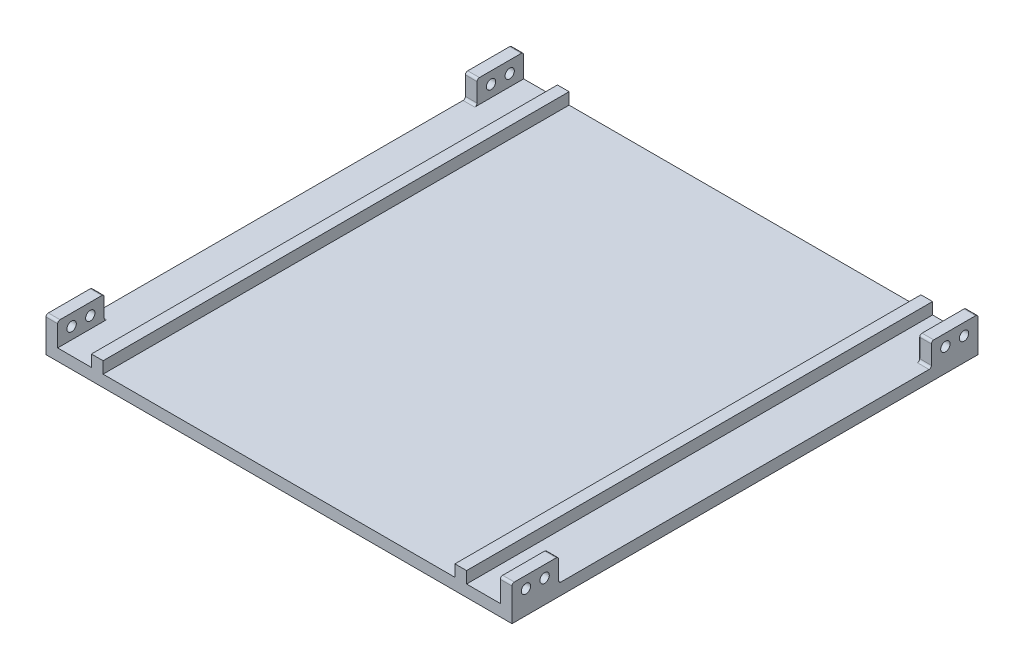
ISO-10303-21;
HEADER;
FILE_DESCRIPTION(('STEP AP214'),'2;1');
FILE_NAME('part.step','',(''),(''),'','','');
FILE_SCHEMA(('AUTOMOTIVE_DESIGN { 1 0 10303 214 1 1 1 1 }'));
ENDSEC;
DATA;
#1=APPLICATION_CONTEXT('core data for automotive mechanical design processes');
#2=APPLICATION_PROTOCOL_DEFINITION('international standard','automotive_design',2000,#1);
#3=PRODUCT_CONTEXT('',#1,'mechanical');
#4=PRODUCT('Part','Part','',(#3));
#5=PRODUCT_RELATED_PRODUCT_CATEGORY('part','',(#4));
#6=PRODUCT_DEFINITION_FORMATION('','',#4);
#7=PRODUCT_DEFINITION_CONTEXT('part definition',#1,'design');
#8=PRODUCT_DEFINITION('design','',#6,#7);
#9=PRODUCT_DEFINITION_SHAPE('','',#8);
#10=(LENGTH_UNIT() NAMED_UNIT(*) SI_UNIT(.MILLI.,.METRE.));
#11=(NAMED_UNIT(*) PLANE_ANGLE_UNIT() SI_UNIT($,.RADIAN.));
#12=(NAMED_UNIT(*) SI_UNIT($,.STERADIAN.) SOLID_ANGLE_UNIT());
#13=UNCERTAINTY_MEASURE_WITH_UNIT(LENGTH_MEASURE(1.E-05),#10,'distance_accuracy_value','');
#14=(GEOMETRIC_REPRESENTATION_CONTEXT(3) GLOBAL_UNCERTAINTY_ASSIGNED_CONTEXT((#13)) GLOBAL_UNIT_ASSIGNED_CONTEXT((#10,
#11,#12)) REPRESENTATION_CONTEXT('',''));
#15=CARTESIAN_POINT('',(0.,0.,0.));
#16=DIRECTION('',(0.,0.,1.));
#17=DIRECTION('',(1.,0.,0.));
#18=AXIS2_PLACEMENT_3D('',#15,#16,#17);
#19=CARTESIAN_POINT('',(100.,-4.99999999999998,100.));
#20=DIRECTION('',(-1.,0.,0.));
#21=DIRECTION('',(0.,0.,1.));
#22=AXIS2_PLACEMENT_3D('',#19,#20,#21);
#23=PLANE('',#22);
#24=CARTESIAN_POINT('',(100.,4.99999999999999,94.));
#25=DIRECTION('',(-1.,0.,0.));
#26=DIRECTION('',(0.,0.,1.));
#27=AXIS2_PLACEMENT_3D('',#24,#25,#26);
#28=CIRCLE('',#27,2.);
#29=CARTESIAN_POINT('',(100.,4.99999999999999,96.));
#30=VERTEX_POINT('',#29);
#31=EDGE_CURVE('E1315',#30,#30,#28,.F.);
#32=ORIENTED_EDGE('',*,*,#31,.F.);
#33=EDGE_LOOP('',(#32));
#34=FACE_BOUND('',#33,.T.);
#35=CARTESIAN_POINT('',(100.,4.99999999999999,-86.));
#36=DIRECTION('',(-1.,0.,0.));
#37=DIRECTION('',(0.,0.,1.));
#38=AXIS2_PLACEMENT_3D('',#35,#36,#37);
#39=CIRCLE('',#38,2.);
#40=CARTESIAN_POINT('',(100.,4.99999999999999,-84.));
#41=VERTEX_POINT('',#40);
#42=EDGE_CURVE('E622',#41,#41,#39,.F.);
#43=ORIENTED_EDGE('',*,*,#42,.F.);
#44=EDGE_LOOP('',(#43));
#45=FACE_BOUND('',#44,.T.);
#46=DIRECTION('',(0.,1.,0.));
#47=VECTOR('',#46,1.);
#48=CARTESIAN_POINT('',(100.,-4.99999999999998,-100.));
#49=LINE('',#48,#47);
#50=CARTESIAN_POINT('',(100.,-4.99999999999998,-100.));
#51=VERTEX_POINT('',#50);
#52=CARTESIAN_POINT('',(100.,8.99999999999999,-100.));
#53=VERTEX_POINT('',#52);
#54=EDGE_CURVE('E504',#51,#53,#49,.T.);
#55=ORIENTED_EDGE('',*,*,#54,.T.);
#56=CARTESIAN_POINT('',(100.,8.99999999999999,-99.));
#57=DIRECTION('',(-1.,0.,0.));
#58=DIRECTION('',(0.,0.,1.));
#59=AXIS2_PLACEMENT_3D('',#56,#57,#58);
#60=CIRCLE('',#59,1.);
#61=CARTESIAN_POINT('',(100.,9.99999999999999,-99.));
#62=VERTEX_POINT('',#61);
#63=EDGE_CURVE('E640',#53,#62,#60,.F.);
#64=ORIENTED_EDGE('',*,*,#63,.T.);
#65=DIRECTION('',(0.,0.,1.));
#66=VECTOR('',#65,1.);
#67=CARTESIAN_POINT('',(100.,9.99999999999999,-100.));
#68=LINE('',#67,#66);
#69=CARTESIAN_POINT('',(100.,9.99999999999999,-81.));
#70=VERTEX_POINT('',#69);
#71=EDGE_CURVE('E315',#62,#70,#68,.T.);
#72=ORIENTED_EDGE('',*,*,#71,.T.);
#73=CARTESIAN_POINT('',(100.,8.99999999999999,-81.));
#74=DIRECTION('',(-1.,0.,0.));
#75=DIRECTION('',(0.,0.,1.));
#76=AXIS2_PLACEMENT_3D('',#73,#74,#75);
#77=CIRCLE('',#76,1.);
#78=CARTESIAN_POINT('',(100.,8.99999999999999,-80.));
#79=VERTEX_POINT('',#78);
#80=EDGE_CURVE('E637',#70,#79,#77,.F.);
#81=ORIENTED_EDGE('',*,*,#80,.T.);
#82=DIRECTION('',(0.,-1.,0.));
#83=VECTOR('',#82,1.);
#84=CARTESIAN_POINT('',(100.,9.99999999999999,-80.));
#85=LINE('',#84,#83);
#86=CARTESIAN_POINT('',(100.,1.00000000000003,-80.));
#87=VERTEX_POINT('',#86);
#88=EDGE_CURVE('E322',#79,#87,#85,.T.);
#89=ORIENTED_EDGE('',*,*,#88,.T.);
#90=CARTESIAN_POINT('',(100.,1.00000000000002,-79.));
#91=DIRECTION('',(-1.,0.,0.));
#92=DIRECTION('',(0.,0.,1.));
#93=AXIS2_PLACEMENT_3D('',#90,#91,#92);
#94=CIRCLE('',#93,1.);
#95=CARTESIAN_POINT('',(100.,0.,-79.));
#96=VERTEX_POINT('',#95);
#97=EDGE_CURVE('E690',#87,#96,#94,.T.);
#98=ORIENTED_EDGE('',*,*,#97,.T.);
#99=DIRECTION('',(0.,0.,-1.));
#100=VECTOR('',#99,1.);
#101=CARTESIAN_POINT('',(100.,0.,100.));
#102=LINE('',#101,#100);
#103=CARTESIAN_POINT('',(100.,0.,79.));
#104=VERTEX_POINT('',#103);
#105=EDGE_CURVE('E511',#104,#96,#102,.T.);
#106=ORIENTED_EDGE('',*,*,#105,.F.);
#107=CARTESIAN_POINT('',(100.,1.00000000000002,79.));
#108=DIRECTION('',(-1.,0.,0.));
#109=DIRECTION('',(0.,0.,1.));
#110=AXIS2_PLACEMENT_3D('',#107,#108,#109);
#111=CIRCLE('',#110,1.);
#112=CARTESIAN_POINT('',(100.,1.00000000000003,80.));
#113=VERTEX_POINT('',#112);
#114=EDGE_CURVE('E46',#104,#113,#111,.T.);
#115=ORIENTED_EDGE('',*,*,#114,.T.);
#116=DIRECTION('',(0.,-1.,0.));
#117=VECTOR('',#116,1.);
#118=CARTESIAN_POINT('',(100.,9.99999999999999,80.));
#119=LINE('',#118,#117);
#120=CARTESIAN_POINT('',(100.,8.99999999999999,80.));
#121=VERTEX_POINT('',#120);
#122=EDGE_CURVE('E345',#121,#113,#119,.T.);
#123=ORIENTED_EDGE('',*,*,#122,.F.);
#124=CARTESIAN_POINT('',(100.,8.99999999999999,81.));
#125=DIRECTION('',(-1.,0.,0.));
#126=DIRECTION('',(0.,0.,1.));
#127=AXIS2_PLACEMENT_3D('',#124,#125,#126);
#128=CIRCLE('',#127,1.);
#129=CARTESIAN_POINT('',(100.,9.99999999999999,81.));
#130=VERTEX_POINT('',#129);
#131=EDGE_CURVE('E634',#121,#130,#128,.F.);
#132=ORIENTED_EDGE('',*,*,#131,.T.);
#133=DIRECTION('',(0.,0.,1.));
#134=VECTOR('',#133,1.);
#135=CARTESIAN_POINT('',(100.,9.99999999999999,100.));
#136=LINE('',#135,#134);
#137=CARTESIAN_POINT('',(100.,9.99999999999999,99.));
#138=VERTEX_POINT('',#137);
#139=EDGE_CURVE('E329',#130,#138,#136,.T.);
#140=ORIENTED_EDGE('',*,*,#139,.T.);
#141=CARTESIAN_POINT('',(100.,8.99999999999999,99.));
#142=DIRECTION('',(-1.,0.,0.));
#143=DIRECTION('',(0.,0.,1.));
#144=AXIS2_PLACEMENT_3D('',#141,#142,#143);
#145=CIRCLE('',#144,1.);
#146=CARTESIAN_POINT('',(100.,8.99999999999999,100.));
#147=VERTEX_POINT('',#146);
#148=EDGE_CURVE('E631',#138,#147,#145,.F.);
#149=ORIENTED_EDGE('',*,*,#148,.T.);
#150=DIRECTION('',(0.,1.,0.));
#151=VECTOR('',#150,1.);
#152=CARTESIAN_POINT('',(100.,-4.99999999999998,100.));
#153=LINE('',#152,#151);
#154=CARTESIAN_POINT('',(100.,-4.99999999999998,100.));
#155=VERTEX_POINT('',#154);
#156=EDGE_CURVE('E489',#155,#147,#153,.T.);
#157=ORIENTED_EDGE('',*,*,#156,.F.);
#158=DIRECTION('',(0.,0.,-1.));
#159=VECTOR('',#158,1.);
#160=CARTESIAN_POINT('',(100.,-4.99999999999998,100.));
#161=LINE('',#160,#159);
#162=EDGE_CURVE('E514',#155,#51,#161,.T.);
#163=ORIENTED_EDGE('',*,*,#162,.T.);
#164=EDGE_LOOP('',(#55,#64,#72,#81,#89,#98,#106,#115,#123,#132,#140,#149,#157,#163));
#165=FACE_BOUND('',#164,.T.);
#166=CARTESIAN_POINT('',(100.,4.99999999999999,86.));
#167=DIRECTION('',(-1.,0.,0.));
#168=DIRECTION('',(0.,0.,1.));
#169=AXIS2_PLACEMENT_3D('',#166,#167,#168);
#170=CIRCLE('',#169,2.);
#171=CARTESIAN_POINT('',(100.,4.99999999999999,88.));
#172=VERTEX_POINT('',#171);
#173=EDGE_CURVE('E1318',#172,#172,#170,.T.);
#174=ORIENTED_EDGE('',*,*,#173,.T.);
#175=EDGE_LOOP('',(#174));
#176=FACE_BOUND('',#175,.T.);
#177=CARTESIAN_POINT('',(100.,4.99999999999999,-94.));
#178=DIRECTION('',(-1.,0.,0.));
#179=DIRECTION('',(0.,0.,1.));
#180=AXIS2_PLACEMENT_3D('',#177,#178,#179);
#181=CIRCLE('',#180,2.);
#182=CARTESIAN_POINT('',(100.,4.99999999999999,-92.));
#183=VERTEX_POINT('',#182);
#184=EDGE_CURVE('E1317',#183,#183,#181,.T.);
#185=ORIENTED_EDGE('',*,*,#184,.T.);
#186=EDGE_LOOP('',(#185));
#187=FACE_BOUND('',#186,.T.);
#188=ADVANCED_FACE('F37',(#34,#45,#165,#176,#187),#23,.F.);
#189=CARTESIAN_POINT('',(95.,9.99999999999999,100.));
#190=DIRECTION('',(-1.,0.,0.));
#191=DIRECTION('',(0.,-1.,0.));
#192=AXIS2_PLACEMENT_3D('',#189,#190,#191);
#193=PLANE('',#192);
#194=CARTESIAN_POINT('',(95.,4.99999999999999,86.));
#195=DIRECTION('',(-1.,0.,0.));
#196=DIRECTION('',(0.,-1.,0.));
#197=AXIS2_PLACEMENT_3D('',#194,#195,#196);
#198=CIRCLE('',#197,2.);
#199=CARTESIAN_POINT('',(95.,3.,86.));
#200=VERTEX_POINT('',#199);
#201=EDGE_CURVE('E318',#200,#200,#198,.F.);
#202=ORIENTED_EDGE('',*,*,#201,.T.);
#203=EDGE_LOOP('',(#202));
#204=FACE_BOUND('',#203,.T.);
#205=DIRECTION('',(0.,0.,-1.));
#206=VECTOR('',#205,1.);
#207=CARTESIAN_POINT('',(95.,9.99999999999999,100.));
#208=LINE('',#207,#206);
#209=CARTESIAN_POINT('',(95.,9.99999999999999,99.));
#210=VERTEX_POINT('',#209);
#211=CARTESIAN_POINT('',(95.,9.99999999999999,81.));
#212=VERTEX_POINT('',#211);
#213=EDGE_CURVE('E333',#210,#212,#208,.T.);
#214=ORIENTED_EDGE('',*,*,#213,.T.);
#215=CARTESIAN_POINT('',(95.,8.99999999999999,81.));
#216=DIRECTION('',(-1.,0.,0.));
#217=DIRECTION('',(0.,-1.,0.));
#218=AXIS2_PLACEMENT_3D('',#215,#216,#217);
#219=CIRCLE('',#218,1.);
#220=CARTESIAN_POINT('',(95.,8.99999999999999,80.));
#221=VERTEX_POINT('',#220);
#222=EDGE_CURVE('E681',#212,#221,#219,.T.);
#223=ORIENTED_EDGE('',*,*,#222,.T.);
#224=DIRECTION('',(0.,-1.,0.));
#225=VECTOR('',#224,1.);
#226=CARTESIAN_POINT('',(95.,9.99999999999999,80.));
#227=LINE('',#226,#225);
#228=CARTESIAN_POINT('',(95.,1.00000000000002,80.));
#229=VERTEX_POINT('',#228);
#230=EDGE_CURVE('E341',#221,#229,#227,.T.);
#231=ORIENTED_EDGE('',*,*,#230,.T.);
#232=CARTESIAN_POINT('',(95.,1.00000000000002,79.));
#233=DIRECTION('',(-1.,0.,0.));
#234=DIRECTION('',(0.,-1.,0.));
#235=AXIS2_PLACEMENT_3D('',#232,#233,#234);
#236=CIRCLE('',#235,1.);
#237=CARTESIAN_POINT('',(95.,0.,79.));
#238=VERTEX_POINT('',#237);
#239=EDGE_CURVE('E11',#229,#238,#236,.F.);
#240=ORIENTED_EDGE('',*,*,#239,.T.);
#241=DIRECTION('',(0.,0.,-1.));
#242=VECTOR('',#241,1.);
#243=CARTESIAN_POINT('',(95.,0.,100.));
#244=LINE('',#243,#242);
#245=CARTESIAN_POINT('',(95.,0.,100.));
#246=VERTEX_POINT('',#245);
#247=EDGE_CURVE('E287',#246,#238,#244,.T.);
#248=ORIENTED_EDGE('',*,*,#247,.F.);
#249=DIRECTION('',(0.,-1.,0.));
#250=VECTOR('',#249,1.);
#251=CARTESIAN_POINT('',(95.,9.99999999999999,100.));
#252=LINE('',#251,#250);
#253=CARTESIAN_POINT('',(95.,8.99999999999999,100.));
#254=VERTEX_POINT('',#253);
#255=EDGE_CURVE('E336',#254,#246,#252,.T.);
#256=ORIENTED_EDGE('',*,*,#255,.F.);
#257=CARTESIAN_POINT('',(95.,8.99999999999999,99.));
#258=DIRECTION('',(-1.,0.,0.));
#259=DIRECTION('',(0.,-1.,0.));
#260=AXIS2_PLACEMENT_3D('',#257,#258,#259);
#261=CIRCLE('',#260,1.);
#262=EDGE_CURVE('E53',#254,#210,#261,.T.);
#263=ORIENTED_EDGE('',*,*,#262,.T.);
#264=EDGE_LOOP('',(#214,#223,#231,#240,#248,#256,#263));
#265=FACE_BOUND('',#264,.T.);
#266=CARTESIAN_POINT('',(95.,4.99999999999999,94.));
#267=DIRECTION('',(-1.,0.,0.));
#268=DIRECTION('',(0.,-1.,0.));
#269=AXIS2_PLACEMENT_3D('',#266,#267,#268);
#270=CIRCLE('',#269,2.);
#271=CARTESIAN_POINT('',(95.,2.99999999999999,94.));
#272=VERTEX_POINT('',#271);
#273=EDGE_CURVE('E311',#272,#272,#270,.T.);
#274=ORIENTED_EDGE('',*,*,#273,.F.);
#275=EDGE_LOOP('',(#274));
#276=FACE_BOUND('',#275,.T.);
#277=ADVANCED_FACE('F708',(#204,#265,#276),#193,.T.);
#278=CARTESIAN_POINT('',(95.,9.99999999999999,-100.));
#279=DIRECTION('',(-1.,0.,0.));
#280=DIRECTION('',(0.,0.,1.));
#281=AXIS2_PLACEMENT_3D('',#278,#279,#280);
#282=PLANE('',#281);
#283=DIRECTION('',(0.,0.,-1.));
#284=VECTOR('',#283,1.);
#285=CARTESIAN_POINT('',(95.,9.99999999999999,-100.));
#286=LINE('',#285,#284);
#287=CARTESIAN_POINT('',(95.,9.99999999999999,-81.));
#288=VERTEX_POINT('',#287);
#289=CARTESIAN_POINT('',(95.,9.99999999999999,-99.));
#290=VERTEX_POINT('',#289);
#291=EDGE_CURVE('E310',#288,#290,#286,.T.);
#292=ORIENTED_EDGE('',*,*,#291,.T.);
#293=CARTESIAN_POINT('',(95.,8.99999999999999,-99.));
#294=DIRECTION('',(-1.,0.,0.));
#295=DIRECTION('',(0.,0.,1.));
#296=AXIS2_PLACEMENT_3D('',#293,#294,#295);
#297=CIRCLE('',#296,1.);
#298=CARTESIAN_POINT('',(95.,8.99999999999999,-100.));
#299=VERTEX_POINT('',#298);
#300=EDGE_CURVE('E282',#290,#299,#297,.T.);
#301=ORIENTED_EDGE('',*,*,#300,.T.);
#302=DIRECTION('',(0.,-1.,0.));
#303=VECTOR('',#302,1.);
#304=CARTESIAN_POINT('',(95.,9.99999999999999,-100.));
#305=LINE('',#304,#303);
#306=CARTESIAN_POINT('',(95.,0.,-100.));
#307=VERTEX_POINT('',#306);
#308=EDGE_CURVE('E273',#299,#307,#305,.T.);
#309=ORIENTED_EDGE('',*,*,#308,.T.);
#310=DIRECTION('',(0.,0.,-1.));
#311=VECTOR('',#310,1.);
#312=CARTESIAN_POINT('',(95.,0.,-100.));
#313=LINE('',#312,#311);
#314=CARTESIAN_POINT('',(95.,0.,-79.));
#315=VERTEX_POINT('',#314);
#316=EDGE_CURVE('E279',#315,#307,#313,.T.);
#317=ORIENTED_EDGE('',*,*,#316,.F.);
#318=CARTESIAN_POINT('',(95.,1.00000000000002,-79.));
#319=DIRECTION('',(-1.,0.,0.));
#320=DIRECTION('',(0.,0.,1.));
#321=AXIS2_PLACEMENT_3D('',#318,#319,#320);
#322=CIRCLE('',#321,1.);
#323=CARTESIAN_POINT('',(95.,1.00000000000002,-80.));
#324=VERTEX_POINT('',#323);
#325=EDGE_CURVE('E687',#315,#324,#322,.F.);
#326=ORIENTED_EDGE('',*,*,#325,.T.);
#327=DIRECTION('',(0.,-1.,0.));
#328=VECTOR('',#327,1.);
#329=CARTESIAN_POINT('',(95.,9.99999999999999,-80.));
#330=LINE('',#329,#328);
#331=CARTESIAN_POINT('',(95.,8.99999999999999,-80.));
#332=VERTEX_POINT('',#331);
#333=EDGE_CURVE('E288',#332,#324,#330,.T.);
#334=ORIENTED_EDGE('',*,*,#333,.F.);
#335=CARTESIAN_POINT('',(95.,8.99999999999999,-81.));
#336=DIRECTION('',(-1.,0.,0.));
#337=DIRECTION('',(0.,0.,1.));
#338=AXIS2_PLACEMENT_3D('',#335,#336,#337);
#339=CIRCLE('',#338,1.);
#340=EDGE_CURVE('E649',#332,#288,#339,.T.);
#341=ORIENTED_EDGE('',*,*,#340,.T.);
#342=EDGE_LOOP('',(#292,#301,#309,#317,#326,#334,#341));
#343=FACE_BOUND('',#342,.T.);
#344=CARTESIAN_POINT('',(95.,4.99999999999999,-86.));
#345=DIRECTION('',(-1.,0.,0.));
#346=DIRECTION('',(0.,0.,1.));
#347=AXIS2_PLACEMENT_3D('',#344,#345,#346);
#348=CIRCLE('',#347,2.);
#349=CARTESIAN_POINT('',(95.,4.99999999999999,-84.));
#350=VERTEX_POINT('',#349);
#351=EDGE_CURVE('E617',#350,#350,#348,.T.);
#352=ORIENTED_EDGE('',*,*,#351,.F.);
#353=EDGE_LOOP('',(#352));
#354=FACE_BOUND('',#353,.T.);
#355=CARTESIAN_POINT('',(95.,4.99999999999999,-94.));
#356=DIRECTION('',(-1.,0.,0.));
#357=DIRECTION('',(0.,0.,1.));
#358=AXIS2_PLACEMENT_3D('',#355,#356,#357);
#359=CIRCLE('',#358,2.);
#360=CARTESIAN_POINT('',(95.,4.99999999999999,-92.));
#361=VERTEX_POINT('',#360);
#362=EDGE_CURVE('E621',#361,#361,#359,.F.);
#363=ORIENTED_EDGE('',*,*,#362,.T.);
#364=EDGE_LOOP('',(#363));
#365=FACE_BOUND('',#364,.T.);
#366=ADVANCED_FACE('F276',(#343,#354,#365),#282,.T.);
#367=CARTESIAN_POINT('',(-100.,-5.,100.));
#368=DIRECTION('',(1.,0.,0.));
#369=DIRECTION('',(0.,0.,-1.));
#370=AXIS2_PLACEMENT_3D('',#367,#368,#369);
#371=PLANE('',#370);
#372=CARTESIAN_POINT('',(-100.,4.99999999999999,86.));
#373=DIRECTION('',(-1.,0.,0.));
#374=DIRECTION('',(0.,0.,1.));
#375=AXIS2_PLACEMENT_3D('',#372,#373,#374);
#376=CIRCLE('',#375,2.);
#377=CARTESIAN_POINT('',(-100.,4.99999999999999,88.));
#378=VERTEX_POINT('',#377);
#379=EDGE_CURVE('E349',#378,#378,#376,.T.);
#380=ORIENTED_EDGE('',*,*,#379,.F.);
#381=EDGE_LOOP('',(#380));
#382=FACE_BOUND('',#381,.T.);
#383=CARTESIAN_POINT('',(-100.,4.99999999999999,-86.));
#384=DIRECTION('',(-1.,0.,0.));
#385=DIRECTION('',(0.,0.,1.));
#386=AXIS2_PLACEMENT_3D('',#383,#384,#385);
#387=CIRCLE('',#386,2.);
#388=CARTESIAN_POINT('',(-100.,4.99999999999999,-84.));
#389=VERTEX_POINT('',#388);
#390=EDGE_CURVE('E358',#389,#389,#387,.F.);
#391=ORIENTED_EDGE('',*,*,#390,.T.);
#392=EDGE_LOOP('',(#391));
#393=FACE_BOUND('',#392,.T.);
#394=DIRECTION('',(0.,0.,1.));
#395=VECTOR('',#394,1.);
#396=CARTESIAN_POINT('',(-100.,9.99999999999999,-100.));
#397=LINE('',#396,#395);
#398=CARTESIAN_POINT('',(-100.,9.99999999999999,-99.));
#399=VERTEX_POINT('',#398);
#400=CARTESIAN_POINT('',(-100.,9.99999999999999,-81.));
#401=VERTEX_POINT('',#400);
#402=EDGE_CURVE('E366',#399,#401,#397,.T.);
#403=ORIENTED_EDGE('',*,*,#402,.F.);
#404=CARTESIAN_POINT('',(-100.,8.99999999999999,-99.));
#405=DIRECTION('',(1.,0.,0.));
#406=DIRECTION('',(0.,0.,-1.));
#407=AXIS2_PLACEMENT_3D('',#404,#405,#406);
#408=CIRCLE('',#407,1.);
#409=CARTESIAN_POINT('',(-100.,8.99999999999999,-100.));
#410=VERTEX_POINT('',#409);
#411=EDGE_CURVE('E553',#399,#410,#408,.F.);
#412=ORIENTED_EDGE('',*,*,#411,.T.);
#413=DIRECTION('',(0.,-1.,0.));
#414=VECTOR('',#413,1.);
#415=CARTESIAN_POINT('',(-100.,-5.,-100.));
#416=LINE('',#415,#414);
#417=CARTESIAN_POINT('',(-100.,-5.,-100.));
#418=VERTEX_POINT('',#417);
#419=EDGE_CURVE('E483',#410,#418,#416,.T.);
#420=ORIENTED_EDGE('',*,*,#419,.T.);
#421=DIRECTION('',(0.,0.,-1.));
#422=VECTOR('',#421,1.);
#423=CARTESIAN_POINT('',(-100.,-5.,100.));
#424=LINE('',#423,#422);
#425=CARTESIAN_POINT('',(-100.,-5.,100.));
#426=VERTEX_POINT('',#425);
#427=EDGE_CURVE('E518',#426,#418,#424,.T.);
#428=ORIENTED_EDGE('',*,*,#427,.F.);
#429=DIRECTION('',(0.,-1.,0.));
#430=VECTOR('',#429,1.);
#431=CARTESIAN_POINT('',(-100.,-5.,100.));
#432=LINE('',#431,#430);
#433=CARTESIAN_POINT('',(-100.,8.99999999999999,100.));
#434=VERTEX_POINT('',#433);
#435=EDGE_CURVE('E300',#434,#426,#432,.T.);
#436=ORIENTED_EDGE('',*,*,#435,.F.);
#437=CARTESIAN_POINT('',(-100.,8.99999999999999,99.));
#438=DIRECTION('',(1.,0.,0.));
#439=DIRECTION('',(0.,0.,-1.));
#440=AXIS2_PLACEMENT_3D('',#437,#438,#439);
#441=CIRCLE('',#440,1.);
#442=CARTESIAN_POINT('',(-100.,9.99999999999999,99.));
#443=VERTEX_POINT('',#442);
#444=EDGE_CURVE('E544',#434,#443,#441,.F.);
#445=ORIENTED_EDGE('',*,*,#444,.T.);
#446=DIRECTION('',(0.,0.,1.));
#447=VECTOR('',#446,1.);
#448=CARTESIAN_POINT('',(-100.,9.99999999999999,100.));
#449=LINE('',#448,#447);
#450=CARTESIAN_POINT('',(-100.,9.99999999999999,81.));
#451=VERTEX_POINT('',#450);
#452=EDGE_CURVE('E391',#451,#443,#449,.T.);
#453=ORIENTED_EDGE('',*,*,#452,.F.);
#454=CARTESIAN_POINT('',(-100.,8.99999999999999,81.));
#455=DIRECTION('',(1.,0.,0.));
#456=DIRECTION('',(0.,0.,-1.));
#457=AXIS2_PLACEMENT_3D('',#454,#455,#456);
#458=CIRCLE('',#457,1.);
#459=CARTESIAN_POINT('',(-100.,8.99999999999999,80.));
#460=VERTEX_POINT('',#459);
#461=EDGE_CURVE('E547',#451,#460,#458,.F.);
#462=ORIENTED_EDGE('',*,*,#461,.T.);
#463=DIRECTION('',(0.,-1.,0.));
#464=VECTOR('',#463,1.);
#465=CARTESIAN_POINT('',(-100.,9.99999999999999,80.));
#466=LINE('',#465,#464);
#467=CARTESIAN_POINT('',(-100.,1.,80.));
#468=VERTEX_POINT('',#467);
#469=EDGE_CURVE('E399',#460,#468,#466,.T.);
#470=ORIENTED_EDGE('',*,*,#469,.T.);
#471=CARTESIAN_POINT('',(-100.,1.,79.));
#472=DIRECTION('',(1.,0.,0.));
#473=DIRECTION('',(0.,0.,-1.));
#474=AXIS2_PLACEMENT_3D('',#471,#472,#473);
#475=CIRCLE('',#474,1.);
#476=CARTESIAN_POINT('',(-100.,0.,79.));
#477=VERTEX_POINT('',#476);
#478=EDGE_CURVE('E610',#468,#477,#475,.T.);
#479=ORIENTED_EDGE('',*,*,#478,.T.);
#480=DIRECTION('',(0.,0.,-1.));
#481=VECTOR('',#480,1.);
#482=CARTESIAN_POINT('',(-100.,0.,100.));
#483=LINE('',#482,#481);
#484=CARTESIAN_POINT('',(-100.,0.,-79.));
#485=VERTEX_POINT('',#484);
#486=EDGE_CURVE('E497',#477,#485,#483,.T.);
#487=ORIENTED_EDGE('',*,*,#486,.T.);
#488=CARTESIAN_POINT('',(-100.,1.,-79.));
#489=DIRECTION('',(1.,0.,0.));
#490=DIRECTION('',(0.,0.,-1.));
#491=AXIS2_PLACEMENT_3D('',#488,#489,#490);
#492=CIRCLE('',#491,1.);
#493=CARTESIAN_POINT('',(-100.,1.,-80.));
#494=VERTEX_POINT('',#493);
#495=EDGE_CURVE('E607',#485,#494,#492,.T.);
#496=ORIENTED_EDGE('',*,*,#495,.T.);
#497=DIRECTION('',(0.,-1.,0.));
#498=VECTOR('',#497,1.);
#499=CARTESIAN_POINT('',(-100.,9.99999999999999,-80.));
#500=LINE('',#499,#498);
#501=CARTESIAN_POINT('',(-100.,8.99999999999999,-80.));
#502=VERTEX_POINT('',#501);
#503=EDGE_CURVE('E386',#502,#494,#500,.T.);
#504=ORIENTED_EDGE('',*,*,#503,.F.);
#505=CARTESIAN_POINT('',(-100.,8.99999999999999,-81.));
#506=DIRECTION('',(1.,0.,0.));
#507=DIRECTION('',(0.,0.,-1.));
#508=AXIS2_PLACEMENT_3D('',#505,#506,#507);
#509=CIRCLE('',#508,1.);
#510=EDGE_CURVE('E550',#502,#401,#509,.F.);
#511=ORIENTED_EDGE('',*,*,#510,.T.);
#512=EDGE_LOOP('',(#403,#412,#420,#428,#436,#445,#453,#462,#470,#479,#487,#496,#504,#511));
#513=FACE_BOUND('',#512,.T.);
#514=CARTESIAN_POINT('',(-100.,4.99999999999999,94.));
#515=DIRECTION('',(-1.,0.,0.));
#516=DIRECTION('',(0.,0.,1.));
#517=AXIS2_PLACEMENT_3D('',#514,#515,#516);
#518=CIRCLE('',#517,2.);
#519=CARTESIAN_POINT('',(-100.,4.99999999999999,96.));
#520=VERTEX_POINT('',#519);
#521=EDGE_CURVE('E353',#520,#520,#518,.F.);
#522=ORIENTED_EDGE('',*,*,#521,.T.);
#523=EDGE_LOOP('',(#522));
#524=FACE_BOUND('',#523,.T.);
#525=CARTESIAN_POINT('',(-100.,4.99999999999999,-94.));
#526=DIRECTION('',(-1.,0.,0.));
#527=DIRECTION('',(0.,0.,1.));
#528=AXIS2_PLACEMENT_3D('',#525,#526,#527);
#529=CIRCLE('',#528,2.);
#530=CARTESIAN_POINT('',(-100.,4.99999999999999,-92.));
#531=VERTEX_POINT('',#530);
#532=EDGE_CURVE('E354',#531,#531,#529,.T.);
#533=ORIENTED_EDGE('',*,*,#532,.F.);
#534=EDGE_LOOP('',(#533));
#535=FACE_BOUND('',#534,.T.);
#536=ADVANCED_FACE('F785',(#382,#393,#513,#524,#535),#371,.F.);
#537=CARTESIAN_POINT('',(-95.,9.99999999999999,100.));
#538=DIRECTION('',(-1.,0.,0.));
#539=DIRECTION('',(0.,-1.,0.));
#540=AXIS2_PLACEMENT_3D('',#537,#538,#539);
#541=PLANE('',#540);
#542=CARTESIAN_POINT('',(-95.,4.99999999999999,86.));
#543=DIRECTION('',(-1.,0.,0.));
#544=DIRECTION('',(0.,-1.,0.));
#545=AXIS2_PLACEMENT_3D('',#542,#543,#544);
#546=CIRCLE('',#545,2.);
#547=CARTESIAN_POINT('',(-95.,3.,86.));
#548=VERTEX_POINT('',#547);
#549=EDGE_CURVE('E530',#548,#548,#546,.T.);
#550=ORIENTED_EDGE('',*,*,#549,.T.);
#551=EDGE_LOOP('',(#550));
#552=FACE_BOUND('',#551,.T.);
#553=DIRECTION('',(0.,-1.,0.));
#554=VECTOR('',#553,1.);
#555=CARTESIAN_POINT('',(-95.,9.99999999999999,80.));
#556=LINE('',#555,#554);
#557=CARTESIAN_POINT('',(-95.,8.99999999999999,80.));
#558=VERTEX_POINT('',#557);
#559=CARTESIAN_POINT('',(-95.,1.,80.));
#560=VERTEX_POINT('',#559);
#561=EDGE_CURVE('E405',#558,#560,#556,.T.);
#562=ORIENTED_EDGE('',*,*,#561,.F.);
#563=CARTESIAN_POINT('',(-95.,8.99999999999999,81.));
#564=DIRECTION('',(-1.,0.,0.));
#565=DIRECTION('',(0.,-1.,0.));
#566=AXIS2_PLACEMENT_3D('',#563,#564,#565);
#567=CIRCLE('',#566,1.);
#568=CARTESIAN_POINT('',(-95.,9.99999999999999,81.));
#569=VERTEX_POINT('',#568);
#570=EDGE_CURVE('E597',#558,#569,#567,.F.);
#571=ORIENTED_EDGE('',*,*,#570,.T.);
#572=DIRECTION('',(0.,0.,-1.));
#573=VECTOR('',#572,1.);
#574=CARTESIAN_POINT('',(-95.,9.99999999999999,100.));
#575=LINE('',#574,#573);
#576=CARTESIAN_POINT('',(-95.,9.99999999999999,99.));
#577=VERTEX_POINT('',#576);
#578=EDGE_CURVE('E395',#577,#569,#575,.T.);
#579=ORIENTED_EDGE('',*,*,#578,.F.);
#580=CARTESIAN_POINT('',(-95.,8.99999999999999,99.));
#581=DIRECTION('',(-1.,0.,0.));
#582=DIRECTION('',(0.,-1.,0.));
#583=AXIS2_PLACEMENT_3D('',#580,#581,#582);
#584=CIRCLE('',#583,1.);
#585=CARTESIAN_POINT('',(-95.,8.99999999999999,100.));
#586=VERTEX_POINT('',#585);
#587=EDGE_CURVE('E594',#577,#586,#584,.F.);
#588=ORIENTED_EDGE('',*,*,#587,.T.);
#589=DIRECTION('',(0.,-1.,0.));
#590=VECTOR('',#589,1.);
#591=CARTESIAN_POINT('',(-95.,9.99999999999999,100.));
#592=LINE('',#591,#590);
#593=CARTESIAN_POINT('',(-95.,0.,100.));
#594=VERTEX_POINT('',#593);
#595=EDGE_CURVE('E409',#586,#594,#592,.T.);
#596=ORIENTED_EDGE('',*,*,#595,.T.);
#597=DIRECTION('',(0.,0.,-1.));
#598=VECTOR('',#597,1.);
#599=CARTESIAN_POINT('',(-95.,0.,100.));
#600=LINE('',#599,#598);
#601=CARTESIAN_POINT('',(-95.,0.,79.));
#602=VERTEX_POINT('',#601);
#603=EDGE_CURVE('E390',#594,#602,#600,.T.);
#604=ORIENTED_EDGE('',*,*,#603,.T.);
#605=CARTESIAN_POINT('',(-95.,1.,79.));
#606=DIRECTION('',(-1.,0.,0.));
#607=DIRECTION('',(0.,-1.,0.));
#608=AXIS2_PLACEMENT_3D('',#605,#606,#607);
#609=CIRCLE('',#608,1.);
#610=EDGE_CURVE('E613',#602,#560,#609,.T.);
#611=ORIENTED_EDGE('',*,*,#610,.T.);
#612=EDGE_LOOP('',(#562,#571,#579,#588,#596,#604,#611));
#613=FACE_BOUND('',#612,.T.);
#614=CARTESIAN_POINT('',(-95.,4.99999999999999,94.));
#615=DIRECTION('',(-1.,0.,0.));
#616=DIRECTION('',(0.,-1.,0.));
#617=AXIS2_PLACEMENT_3D('',#614,#615,#616);
#618=CIRCLE('',#617,2.);
#619=CARTESIAN_POINT('',(-95.,2.99999999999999,94.));
#620=VERTEX_POINT('',#619);
#621=EDGE_CURVE('E379',#620,#620,#618,.F.);
#622=ORIENTED_EDGE('',*,*,#621,.F.);
#623=EDGE_LOOP('',(#622));
#624=FACE_BOUND('',#623,.T.);
#625=ADVANCED_FACE('F813',(#552,#613,#624),#541,.F.);
#626=CARTESIAN_POINT('',(-95.,9.99999999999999,-100.));
#627=DIRECTION('',(-1.,0.,0.));
#628=DIRECTION('',(0.,0.,1.));
#629=AXIS2_PLACEMENT_3D('',#626,#627,#628);
#630=PLANE('',#629);
#631=DIRECTION('',(0.,-1.,0.));
#632=VECTOR('',#631,1.);
#633=CARTESIAN_POINT('',(-95.,9.99999999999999,-100.));
#634=LINE('',#633,#632);
#635=CARTESIAN_POINT('',(-95.,8.99999999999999,-100.));
#636=VERTEX_POINT('',#635);
#637=CARTESIAN_POINT('',(-95.,0.,-100.));
#638=VERTEX_POINT('',#637);
#639=EDGE_CURVE('E375',#636,#638,#634,.T.);
#640=ORIENTED_EDGE('',*,*,#639,.F.);
#641=CARTESIAN_POINT('',(-95.,8.99999999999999,-99.));
#642=DIRECTION('',(-1.,0.,0.));
#643=DIRECTION('',(0.,0.,1.));
#644=AXIS2_PLACEMENT_3D('',#641,#642,#643);
#645=CIRCLE('',#644,1.);
#646=CARTESIAN_POINT('',(-95.,9.99999999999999,-99.));
#647=VERTEX_POINT('',#646);
#648=EDGE_CURVE('E562',#636,#647,#645,.F.);
#649=ORIENTED_EDGE('',*,*,#648,.T.);
#650=DIRECTION('',(0.,0.,-1.));
#651=VECTOR('',#650,1.);
#652=CARTESIAN_POINT('',(-95.,9.99999999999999,-100.));
#653=LINE('',#652,#651);
#654=CARTESIAN_POINT('',(-95.,9.99999999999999,-81.));
#655=VERTEX_POINT('',#654);
#656=EDGE_CURVE('E370',#655,#647,#653,.T.);
#657=ORIENTED_EDGE('',*,*,#656,.F.);
#658=CARTESIAN_POINT('',(-95.,8.99999999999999,-81.));
#659=DIRECTION('',(-1.,0.,0.));
#660=DIRECTION('',(0.,0.,1.));
#661=AXIS2_PLACEMENT_3D('',#658,#659,#660);
#662=CIRCLE('',#661,1.);
#663=CARTESIAN_POINT('',(-95.,8.99999999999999,-80.));
#664=VERTEX_POINT('',#663);
#665=EDGE_CURVE('E559',#655,#664,#662,.F.);
#666=ORIENTED_EDGE('',*,*,#665,.T.);
#667=DIRECTION('',(0.,-1.,0.));
#668=VECTOR('',#667,1.);
#669=CARTESIAN_POINT('',(-95.,9.99999999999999,-80.));
#670=LINE('',#669,#668);
#671=CARTESIAN_POINT('',(-95.,1.,-80.));
#672=VERTEX_POINT('',#671);
#673=EDGE_CURVE('E382',#664,#672,#670,.T.);
#674=ORIENTED_EDGE('',*,*,#673,.T.);
#675=CARTESIAN_POINT('',(-95.,1.,-79.));
#676=DIRECTION('',(-1.,0.,0.));
#677=DIRECTION('',(0.,0.,1.));
#678=AXIS2_PLACEMENT_3D('',#675,#676,#677);
#679=CIRCLE('',#678,1.);
#680=CARTESIAN_POINT('',(-95.,0.,-79.));
#681=VERTEX_POINT('',#680);
#682=EDGE_CURVE('E603',#672,#681,#679,.T.);
#683=ORIENTED_EDGE('',*,*,#682,.T.);
#684=DIRECTION('',(0.,0.,-1.));
#685=VECTOR('',#684,1.);
#686=CARTESIAN_POINT('',(-95.,0.,-100.));
#687=LINE('',#686,#685);
#688=EDGE_CURVE('E371',#681,#638,#687,.T.);
#689=ORIENTED_EDGE('',*,*,#688,.T.);
#690=EDGE_LOOP('',(#640,#649,#657,#666,#674,#683,#689));
#691=FACE_BOUND('',#690,.T.);
#692=CARTESIAN_POINT('',(-95.,4.99999999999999,-86.));
#693=DIRECTION('',(-1.,0.,0.));
#694=DIRECTION('',(0.,0.,1.));
#695=AXIS2_PLACEMENT_3D('',#692,#693,#694);
#696=CIRCLE('',#695,2.);
#697=CARTESIAN_POINT('',(-95.,4.99999999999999,-84.));
#698=VERTEX_POINT('',#697);
#699=EDGE_CURVE('E365',#698,#698,#696,.F.);
#700=ORIENTED_EDGE('',*,*,#699,.F.);
#701=EDGE_LOOP('',(#700));
#702=FACE_BOUND('',#701,.T.);
#703=CARTESIAN_POINT('',(-95.,4.99999999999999,-94.));
#704=DIRECTION('',(-1.,0.,0.));
#705=DIRECTION('',(0.,0.,1.));
#706=AXIS2_PLACEMENT_3D('',#703,#704,#705);
#707=CIRCLE('',#706,2.);
#708=CARTESIAN_POINT('',(-95.,4.99999999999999,-92.));
#709=VERTEX_POINT('',#708);
#710=EDGE_CURVE('E526',#709,#709,#707,.T.);
#711=ORIENTED_EDGE('',*,*,#710,.T.);
#712=EDGE_LOOP('',(#711));
#713=FACE_BOUND('',#712,.T.);
#714=ADVANCED_FACE('F774',(#691,#702,#713),#630,.F.);
#715=CARTESIAN_POINT('',(-100.,0.,100.));
#716=DIRECTION('',(0.,-1.,0.));
#717=DIRECTION('',(1.,0.,0.));
#718=AXIS2_PLACEMENT_3D('',#715,#716,#717);
#719=PLANE('',#718);
#720=ORIENTED_EDGE('',*,*,#688,.F.);
#721=DIRECTION('',(1.,0.,0.));
#722=VECTOR('',#721,1.);
#723=CARTESIAN_POINT('',(-100.,0.,-79.));
#724=LINE('',#723,#722);
#725=EDGE_CURVE('E576',#681,#485,#724,.F.);
#726=ORIENTED_EDGE('',*,*,#725,.T.);
#727=ORIENTED_EDGE('',*,*,#486,.F.);
#728=DIRECTION('',(-1.,0.,0.));
#729=VECTOR('',#728,1.);
#730=CARTESIAN_POINT('',(-95.,0.,79.));
#731=LINE('',#730,#729);
#732=EDGE_CURVE('E572',#477,#602,#731,.F.);
#733=ORIENTED_EDGE('',*,*,#732,.T.);
#734=ORIENTED_EDGE('',*,*,#603,.F.);
#735=DIRECTION('',(-1.,0.,0.));
#736=VECTOR('',#735,1.);
#737=CARTESIAN_POINT('',(-100.,0.,100.));
#738=LINE('',#737,#736);
#739=CARTESIAN_POINT('',(-80.5,0.,100.));
#740=VERTEX_POINT('',#739);
#741=EDGE_CURVE('E493',#740,#594,#738,.T.);
#742=ORIENTED_EDGE('',*,*,#741,.F.);
#743=DIRECTION('',(0.,0.,1.));
#744=VECTOR('',#743,1.);
#745=CARTESIAN_POINT('',(-80.5,0.,-100.));
#746=LINE('',#745,#744);
#747=CARTESIAN_POINT('',(-80.5,0.,-100.));
#748=VERTEX_POINT('',#747);
#749=EDGE_CURVE('E446',#748,#740,#746,.T.);
#750=ORIENTED_EDGE('',*,*,#749,.F.);
#751=DIRECTION('',(-1.,0.,0.));
#752=VECTOR('',#751,1.);
#753=CARTESIAN_POINT('',(-100.,0.,-100.));
#754=LINE('',#753,#752);
#755=EDGE_CURVE('E303',#748,#638,#754,.T.);
#756=ORIENTED_EDGE('',*,*,#755,.T.);
#757=EDGE_LOOP('',(#720,#726,#727,#733,#734,#742,#750,#756));
#758=FACE_BOUND('',#757,.T.);
#759=ADVANCED_FACE('F768',(#758),#719,.F.);
#760=DIRECTION('',(0.,0.,1.));
#761=VECTOR('',#760,1.);
#762=CARTESIAN_POINT('',(75.5,0.,-100.));
#763=LINE('',#762,#761);
#764=CARTESIAN_POINT('',(75.5,0.,-100.));
#765=VERTEX_POINT('',#764);
#766=CARTESIAN_POINT('',(75.5,0.,100.));
#767=VERTEX_POINT('',#766);
#768=EDGE_CURVE('E412',#765,#767,#763,.T.);
#769=ORIENTED_EDGE('',*,*,#768,.F.);
#770=CARTESIAN_POINT('',(-75.5,0.,-100.));
#771=VERTEX_POINT('',#770);
#772=EDGE_CURVE('E301',#765,#771,#754,.T.);
#773=ORIENTED_EDGE('',*,*,#772,.T.);
#774=DIRECTION('',(0.,0.,-1.));
#775=VECTOR('',#774,1.);
#776=CARTESIAN_POINT('',(-75.5,0.,-100.));
#777=LINE('',#776,#775);
#778=CARTESIAN_POINT('',(-75.5,0.,100.));
#779=VERTEX_POINT('',#778);
#780=EDGE_CURVE('E452',#779,#771,#777,.T.);
#781=ORIENTED_EDGE('',*,*,#780,.F.);
#782=EDGE_CURVE('E498',#767,#779,#738,.T.);
#783=ORIENTED_EDGE('',*,*,#782,.F.);
#784=EDGE_LOOP('',(#769,#773,#781,#783));
#785=FACE_BOUND('',#784,.T.);
#786=ADVANCED_FACE('F753',(#785),#719,.F.);
#787=ORIENTED_EDGE('',*,*,#105,.T.);
#788=DIRECTION('',(-1.,0.,0.));
#789=VECTOR('',#788,1.);
#790=CARTESIAN_POINT('',(-100.,0.,-79.));
#791=LINE('',#790,#789);
#792=EDGE_CURVE('E308',#96,#315,#791,.T.);
#793=ORIENTED_EDGE('',*,*,#792,.T.);
#794=ORIENTED_EDGE('',*,*,#316,.T.);
#795=CARTESIAN_POINT('',(80.5,0.,-100.));
#796=VERTEX_POINT('',#795);
#797=EDGE_CURVE('E291',#307,#796,#754,.T.);
#798=ORIENTED_EDGE('',*,*,#797,.T.);
#799=DIRECTION('',(0.,0.,-1.));
#800=VECTOR('',#799,1.);
#801=CARTESIAN_POINT('',(80.5,0.,-100.));
#802=LINE('',#801,#800);
#803=CARTESIAN_POINT('',(80.5,0.,100.));
#804=VERTEX_POINT('',#803);
#805=EDGE_CURVE('E418',#804,#796,#802,.T.);
#806=ORIENTED_EDGE('',*,*,#805,.F.);
#807=EDGE_CURVE('E494',#246,#804,#738,.T.);
#808=ORIENTED_EDGE('',*,*,#807,.F.);
#809=ORIENTED_EDGE('',*,*,#247,.T.);
#810=DIRECTION('',(1.,0.,0.));
#811=VECTOR('',#810,1.);
#812=CARTESIAN_POINT('',(-100.,0.,79.));
#813=LINE('',#812,#811);
#814=EDGE_CURVE('E661',#238,#104,#813,.T.);
#815=ORIENTED_EDGE('',*,*,#814,.T.);
#816=EDGE_LOOP('',(#787,#793,#794,#798,#806,#808,#809,#815));
#817=FACE_BOUND('',#816,.T.);
#818=ADVANCED_FACE('F306',(#817),#719,.F.);
#819=CARTESIAN_POINT('',(-100.,-5.,100.));
#820=DIRECTION('',(0.,1.,0.));
#821=DIRECTION('',(-1.,0.,0.));
#822=AXIS2_PLACEMENT_3D('',#819,#820,#821);
#823=PLANE('',#822);
#824=DIRECTION('',(1.,0.,0.));
#825=VECTOR('',#824,1.);
#826=CARTESIAN_POINT('',(-100.,-5.,-100.));
#827=LINE('',#826,#825);
#828=EDGE_CURVE('E501',#418,#51,#827,.T.);
#829=ORIENTED_EDGE('',*,*,#828,.T.);
#830=ORIENTED_EDGE('',*,*,#162,.F.);
#831=DIRECTION('',(1.,0.,0.));
#832=VECTOR('',#831,1.);
#833=CARTESIAN_POINT('',(-100.,-5.,100.));
#834=LINE('',#833,#832);
#835=EDGE_CURVE('E486',#426,#155,#834,.T.);
#836=ORIENTED_EDGE('',*,*,#835,.F.);
#837=ORIENTED_EDGE('',*,*,#427,.T.);
#838=EDGE_LOOP('',(#829,#830,#836,#837));
#839=FACE_BOUND('',#838,.T.);
#840=ADVANCED_FACE('F725',(#839),#823,.F.);
#841=CARTESIAN_POINT('',(0.,0.,100.));
#842=DIRECTION('',(0.,0.,-1.));
#843=DIRECTION('',(-1.,0.,0.));
#844=AXIS2_PLACEMENT_3D('',#841,#842,#843);
#845=PLANE('',#844);
#846=ORIENTED_EDGE('',*,*,#156,.T.);
#847=DIRECTION('',(-1.,0.,0.));
#848=VECTOR('',#847,1.);
#849=CARTESIAN_POINT('',(0.,9.,100.));
#850=LINE('',#849,#848);
#851=EDGE_CURVE('E684',#147,#254,#850,.T.);
#852=ORIENTED_EDGE('',*,*,#851,.T.);
#853=ORIENTED_EDGE('',*,*,#255,.T.);
#854=ORIENTED_EDGE('',*,*,#807,.T.);
#855=DIRECTION('',(0.,-1.,0.));
#856=VECTOR('',#855,1.);
#857=CARTESIAN_POINT('',(80.5,5.00000000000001,100.));
#858=LINE('',#857,#856);
#859=CARTESIAN_POINT('',(80.5,5.00000000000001,100.));
#860=VERTEX_POINT('',#859);
#861=EDGE_CURVE('E434',#860,#804,#858,.T.);
#862=ORIENTED_EDGE('',*,*,#861,.F.);
#863=DIRECTION('',(1.,0.,0.));
#864=VECTOR('',#863,1.);
#865=CARTESIAN_POINT('',(80.5,5.00000000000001,100.));
#866=LINE('',#865,#864);
#867=CARTESIAN_POINT('',(75.5,5.00000000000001,100.));
#868=VERTEX_POINT('',#867);
#869=EDGE_CURVE('E421',#868,#860,#866,.T.);
#870=ORIENTED_EDGE('',*,*,#869,.F.);
#871=DIRECTION('',(0.,-1.,0.));
#872=VECTOR('',#871,1.);
#873=CARTESIAN_POINT('',(75.5,5.00000000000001,100.));
#874=LINE('',#873,#872);
#875=EDGE_CURVE('E438',#868,#767,#874,.T.);
#876=ORIENTED_EDGE('',*,*,#875,.T.);
#877=ORIENTED_EDGE('',*,*,#782,.T.);
#878=DIRECTION('',(0.,-1.,0.));
#879=VECTOR('',#878,1.);
#880=CARTESIAN_POINT('',(-75.5,4.99999999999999,100.));
#881=LINE('',#880,#879);
#882=CARTESIAN_POINT('',(-75.5,4.99999999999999,100.));
#883=VERTEX_POINT('',#882);
#884=EDGE_CURVE('E475',#883,#779,#881,.T.);
#885=ORIENTED_EDGE('',*,*,#884,.F.);
#886=DIRECTION('',(1.,0.,0.));
#887=VECTOR('',#886,1.);
#888=CARTESIAN_POINT('',(-80.5,4.99999999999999,100.));
#889=LINE('',#888,#887);
#890=CARTESIAN_POINT('',(-80.5,4.99999999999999,100.));
#891=VERTEX_POINT('',#890);
#892=EDGE_CURVE('E451',#891,#883,#889,.T.);
#893=ORIENTED_EDGE('',*,*,#892,.F.);
#894=DIRECTION('',(0.,-1.,0.));
#895=VECTOR('',#894,1.);
#896=CARTESIAN_POINT('',(-80.5,4.99999999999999,100.));
#897=LINE('',#896,#895);
#898=EDGE_CURVE('E479',#891,#740,#897,.T.);
#899=ORIENTED_EDGE('',*,*,#898,.T.);
#900=ORIENTED_EDGE('',*,*,#741,.T.);
#901=ORIENTED_EDGE('',*,*,#595,.F.);
#902=DIRECTION('',(1.,0.,0.));
#903=VECTOR('',#902,1.);
#904=CARTESIAN_POINT('',(0.,9.,100.));
#905=LINE('',#904,#903);
#906=EDGE_CURVE('E600',#586,#434,#905,.F.);
#907=ORIENTED_EDGE('',*,*,#906,.T.);
#908=ORIENTED_EDGE('',*,*,#435,.T.);
#909=ORIENTED_EDGE('',*,*,#835,.T.);
#910=EDGE_LOOP('',(#846,#852,#853,#854,#862,#870,#876,#877,#885,#893,#899,#900,#901,#907,#908,#909));
#911=FACE_BOUND('',#910,.T.);
#912=ADVANCED_FACE('F719',(#911),#845,.F.);
#913=CARTESIAN_POINT('',(0.,0.,-100.));
#914=DIRECTION('',(0.,0.,-1.));
#915=DIRECTION('',(-1.,0.,0.));
#916=AXIS2_PLACEMENT_3D('',#913,#914,#915);
#917=PLANE('',#916);
#918=ORIENTED_EDGE('',*,*,#308,.F.);
#919=DIRECTION('',(1.,0.,0.));
#920=VECTOR('',#919,1.);
#921=CARTESIAN_POINT('',(100.,8.99999999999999,-100.));
#922=LINE('',#921,#920);
#923=EDGE_CURVE('E616',#299,#53,#922,.T.);
#924=ORIENTED_EDGE('',*,*,#923,.T.);
#925=ORIENTED_EDGE('',*,*,#54,.F.);
#926=ORIENTED_EDGE('',*,*,#828,.F.);
#927=ORIENTED_EDGE('',*,*,#419,.F.);
#928=DIRECTION('',(-1.,0.,0.));
#929=VECTOR('',#928,1.);
#930=CARTESIAN_POINT('',(-95.,8.99999999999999,-100.));
#931=LINE('',#930,#929);
#932=EDGE_CURVE('E556',#410,#636,#931,.F.);
#933=ORIENTED_EDGE('',*,*,#932,.T.);
#934=ORIENTED_EDGE('',*,*,#639,.T.);
#935=ORIENTED_EDGE('',*,*,#755,.F.);
#936=DIRECTION('',(0.,-1.,0.));
#937=VECTOR('',#936,1.);
#938=CARTESIAN_POINT('',(-80.5,4.99999999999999,-100.));
#939=LINE('',#938,#937);
#940=CARTESIAN_POINT('',(-80.5,4.99999999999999,-100.));
#941=VERTEX_POINT('',#940);
#942=EDGE_CURVE('E461',#941,#748,#939,.T.);
#943=ORIENTED_EDGE('',*,*,#942,.F.);
#944=DIRECTION('',(-1.,0.,0.));
#945=VECTOR('',#944,1.);
#946=CARTESIAN_POINT('',(-80.5,4.99999999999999,-100.));
#947=LINE('',#946,#945);
#948=CARTESIAN_POINT('',(-75.5,4.99999999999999,-100.));
#949=VERTEX_POINT('',#948);
#950=EDGE_CURVE('E458',#949,#941,#947,.T.);
#951=ORIENTED_EDGE('',*,*,#950,.F.);
#952=DIRECTION('',(0.,-1.,0.));
#953=VECTOR('',#952,1.);
#954=CARTESIAN_POINT('',(-75.5,4.99999999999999,-100.));
#955=LINE('',#954,#953);
#956=EDGE_CURVE('E471',#949,#771,#955,.T.);
#957=ORIENTED_EDGE('',*,*,#956,.T.);
#958=ORIENTED_EDGE('',*,*,#772,.F.);
#959=DIRECTION('',(0.,-1.,0.));
#960=VECTOR('',#959,1.);
#961=CARTESIAN_POINT('',(75.5,5.00000000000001,-100.));
#962=LINE('',#961,#960);
#963=CARTESIAN_POINT('',(75.5,5.00000000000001,-100.));
#964=VERTEX_POINT('',#963);
#965=EDGE_CURVE('E442',#964,#765,#962,.T.);
#966=ORIENTED_EDGE('',*,*,#965,.F.);
#967=DIRECTION('',(-1.,0.,0.));
#968=VECTOR('',#967,1.);
#969=CARTESIAN_POINT('',(80.5,5.00000000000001,-100.));
#970=LINE('',#969,#968);
#971=CARTESIAN_POINT('',(80.5,5.00000000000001,-100.));
#972=VERTEX_POINT('',#971);
#973=EDGE_CURVE('E413',#972,#964,#970,.T.);
#974=ORIENTED_EDGE('',*,*,#973,.F.);
#975=DIRECTION('',(0.,-1.,0.));
#976=VECTOR('',#975,1.);
#977=CARTESIAN_POINT('',(80.5,5.00000000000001,-100.));
#978=LINE('',#977,#976);
#979=EDGE_CURVE('E295',#972,#796,#978,.T.);
#980=ORIENTED_EDGE('',*,*,#979,.T.);
#981=ORIENTED_EDGE('',*,*,#797,.F.);
#982=EDGE_LOOP('',(#918,#924,#925,#926,#927,#933,#934,#935,#943,#951,#957,#958,#966,#974,#980,#981));
#983=FACE_BOUND('',#982,.T.);
#984=ADVANCED_FACE('F292',(#983),#917,.T.);
#985=CARTESIAN_POINT('',(-80.5,4.99999999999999,-100.));
#986=DIRECTION('',(1.,0.,0.));
#987=DIRECTION('',(0.,0.,-1.));
#988=AXIS2_PLACEMENT_3D('',#985,#986,#987);
#989=PLANE('',#988);
#990=ORIENTED_EDGE('',*,*,#749,.T.);
#991=ORIENTED_EDGE('',*,*,#898,.F.);
#992=DIRECTION('',(0.,0.,1.));
#993=VECTOR('',#992,1.);
#994=CARTESIAN_POINT('',(-80.5,4.99999999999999,-100.));
#995=LINE('',#994,#993);
#996=EDGE_CURVE('E447',#941,#891,#995,.T.);
#997=ORIENTED_EDGE('',*,*,#996,.F.);
#998=ORIENTED_EDGE('',*,*,#942,.T.);
#999=EDGE_LOOP('',(#990,#991,#997,#998));
#1000=FACE_BOUND('',#999,.T.);
#1001=ADVANCED_FACE('F765',(#1000),#989,.F.);
#1002=CARTESIAN_POINT('',(-75.5,4.99999999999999,-100.));
#1003=DIRECTION('',(-1.,0.,0.));
#1004=DIRECTION('',(0.,0.,1.));
#1005=AXIS2_PLACEMENT_3D('',#1002,#1003,#1004);
#1006=PLANE('',#1005);
#1007=ORIENTED_EDGE('',*,*,#780,.T.);
#1008=ORIENTED_EDGE('',*,*,#956,.F.);
#1009=DIRECTION('',(0.,0.,-1.));
#1010=VECTOR('',#1009,1.);
#1011=CARTESIAN_POINT('',(-75.5,4.99999999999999,-100.));
#1012=LINE('',#1011,#1010);
#1013=EDGE_CURVE('E455',#883,#949,#1012,.T.);
#1014=ORIENTED_EDGE('',*,*,#1013,.F.);
#1015=ORIENTED_EDGE('',*,*,#884,.T.);
#1016=EDGE_LOOP('',(#1007,#1008,#1014,#1015));
#1017=FACE_BOUND('',#1016,.T.);
#1018=ADVANCED_FACE('F756',(#1017),#1006,.F.);
#1019=CARTESIAN_POINT('',(0.,5.,0.));
#1020=DIRECTION('',(0.,1.,0.));
#1021=DIRECTION('',(-1.,0.,0.));
#1022=AXIS2_PLACEMENT_3D('',#1019,#1020,#1021);
#1023=PLANE('',#1022);
#1024=ORIENTED_EDGE('',*,*,#996,.T.);
#1025=ORIENTED_EDGE('',*,*,#892,.T.);
#1026=ORIENTED_EDGE('',*,*,#1013,.T.);
#1027=ORIENTED_EDGE('',*,*,#950,.T.);
#1028=EDGE_LOOP('',(#1024,#1025,#1026,#1027));
#1029=FACE_BOUND('',#1028,.T.);
#1030=ADVANCED_FACE('F759',(#1029),#1023,.T.);
#1031=CARTESIAN_POINT('',(75.5,5.00000000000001,-100.));
#1032=DIRECTION('',(1.,0.,0.));
#1033=DIRECTION('',(0.,0.,-1.));
#1034=AXIS2_PLACEMENT_3D('',#1031,#1032,#1033);
#1035=PLANE('',#1034);
#1036=ORIENTED_EDGE('',*,*,#768,.T.);
#1037=ORIENTED_EDGE('',*,*,#875,.F.);
#1038=DIRECTION('',(0.,0.,1.));
#1039=VECTOR('',#1038,1.);
#1040=CARTESIAN_POINT('',(75.5,5.00000000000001,-100.));
#1041=LINE('',#1040,#1039);
#1042=EDGE_CURVE('E417',#964,#868,#1041,.T.);
#1043=ORIENTED_EDGE('',*,*,#1042,.F.);
#1044=ORIENTED_EDGE('',*,*,#965,.T.);
#1045=EDGE_LOOP('',(#1036,#1037,#1043,#1044));
#1046=FACE_BOUND('',#1045,.T.);
#1047=ADVANCED_FACE('F1064',(#1046),#1035,.F.);
#1048=CARTESIAN_POINT('',(80.5,5.00000000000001,-100.));
#1049=DIRECTION('',(-1.,0.,0.));
#1050=DIRECTION('',(0.,0.,1.));
#1051=AXIS2_PLACEMENT_3D('',#1048,#1049,#1050);
#1052=PLANE('',#1051);
#1053=ORIENTED_EDGE('',*,*,#805,.T.);
#1054=ORIENTED_EDGE('',*,*,#979,.F.);
#1055=DIRECTION('',(0.,0.,-1.));
#1056=VECTOR('',#1055,1.);
#1057=CARTESIAN_POINT('',(80.5,5.00000000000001,-100.));
#1058=LINE('',#1057,#1056);
#1059=EDGE_CURVE('E424',#860,#972,#1058,.T.);
#1060=ORIENTED_EDGE('',*,*,#1059,.F.);
#1061=ORIENTED_EDGE('',*,*,#861,.T.);
#1062=EDGE_LOOP('',(#1053,#1054,#1060,#1061));
#1063=FACE_BOUND('',#1062,.T.);
#1064=ADVANCED_FACE('F1059',(#1063),#1052,.F.);
#1065=CARTESIAN_POINT('',(0.,5.,0.));
#1066=DIRECTION('',(0.,1.,0.));
#1067=DIRECTION('',(-1.,0.,0.));
#1068=AXIS2_PLACEMENT_3D('',#1065,#1066,#1067);
#1069=PLANE('',#1068);
#1070=ORIENTED_EDGE('',*,*,#973,.T.);
#1071=ORIENTED_EDGE('',*,*,#1042,.T.);
#1072=ORIENTED_EDGE('',*,*,#869,.T.);
#1073=ORIENTED_EDGE('',*,*,#1059,.T.);
#1074=EDGE_LOOP('',(#1070,#1071,#1072,#1073));
#1075=FACE_BOUND('',#1074,.T.);
#1076=ADVANCED_FACE('F1061',(#1075),#1069,.T.);
#1077=CARTESIAN_POINT('',(-100.,9.99999999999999,80.));
#1078=DIRECTION('',(0.,0.,1.));
#1079=DIRECTION('',(1.,0.,0.));
#1080=AXIS2_PLACEMENT_3D('',#1077,#1078,#1079);
#1081=PLANE('',#1080);
#1082=ORIENTED_EDGE('',*,*,#561,.T.);
#1083=DIRECTION('',(-1.,0.,0.));
#1084=VECTOR('',#1083,1.);
#1085=CARTESIAN_POINT('',(-100.,1.,80.));
#1086=LINE('',#1085,#1084);
#1087=EDGE_CURVE('E582',#560,#468,#1086,.T.);
#1088=ORIENTED_EDGE('',*,*,#1087,.T.);
#1089=ORIENTED_EDGE('',*,*,#469,.F.);
#1090=DIRECTION('',(-1.,0.,0.));
#1091=VECTOR('',#1090,1.);
#1092=CARTESIAN_POINT('',(-100.,8.99999999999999,80.));
#1093=LINE('',#1092,#1091);
#1094=EDGE_CURVE('E579',#460,#558,#1093,.F.);
#1095=ORIENTED_EDGE('',*,*,#1094,.T.);
#1096=EDGE_LOOP('',(#1082,#1088,#1089,#1095));
#1097=FACE_BOUND('',#1096,.T.);
#1098=ADVANCED_FACE('F808',(#1097),#1081,.F.);
#1099=CARTESIAN_POINT('',(0.,10.,0.));
#1100=DIRECTION('',(0.,-1.,0.));
#1101=DIRECTION('',(1.,0.,0.));
#1102=AXIS2_PLACEMENT_3D('',#1099,#1100,#1101);
#1103=PLANE('',#1102);
#1104=ORIENTED_EDGE('',*,*,#578,.T.);
#1105=DIRECTION('',(-1.,0.,0.));
#1106=VECTOR('',#1105,1.);
#1107=CARTESIAN_POINT('',(0.,10.,81.));
#1108=LINE('',#1107,#1106);
#1109=EDGE_CURVE('E590',#569,#451,#1108,.T.);
#1110=ORIENTED_EDGE('',*,*,#1109,.T.);
#1111=ORIENTED_EDGE('',*,*,#452,.T.);
#1112=DIRECTION('',(1.,0.,0.));
#1113=VECTOR('',#1112,1.);
#1114=CARTESIAN_POINT('',(0.,10.,99.));
#1115=LINE('',#1114,#1113);
#1116=EDGE_CURVE('E586',#443,#577,#1115,.T.);
#1117=ORIENTED_EDGE('',*,*,#1116,.T.);
#1118=EDGE_LOOP('',(#1104,#1110,#1111,#1117));
#1119=FACE_BOUND('',#1118,.T.);
#1120=ADVANCED_FACE('F821',(#1119),#1103,.F.);
#1121=CARTESIAN_POINT('',(-100.,9.99999999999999,-80.));
#1122=DIRECTION('',(0.,0.,-1.));
#1123=DIRECTION('',(-1.,0.,0.));
#1124=AXIS2_PLACEMENT_3D('',#1121,#1122,#1123);
#1125=PLANE('',#1124);
#1126=ORIENTED_EDGE('',*,*,#673,.F.);
#1127=DIRECTION('',(1.,0.,0.));
#1128=VECTOR('',#1127,1.);
#1129=CARTESIAN_POINT('',(-100.,8.99999999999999,-80.));
#1130=LINE('',#1129,#1128);
#1131=EDGE_CURVE('E569',#664,#502,#1130,.F.);
#1132=ORIENTED_EDGE('',*,*,#1131,.T.);
#1133=ORIENTED_EDGE('',*,*,#503,.T.);
#1134=DIRECTION('',(1.,0.,0.));
#1135=VECTOR('',#1134,1.);
#1136=CARTESIAN_POINT('',(-95.,1.,-80.));
#1137=LINE('',#1136,#1135);
#1138=EDGE_CURVE('E565',#494,#672,#1137,.T.);
#1139=ORIENTED_EDGE('',*,*,#1138,.T.);
#1140=EDGE_LOOP('',(#1126,#1132,#1133,#1139));
#1141=FACE_BOUND('',#1140,.T.);
#1142=ADVANCED_FACE('F794',(#1141),#1125,.F.);
#1143=CARTESIAN_POINT('',(0.,10.,0.));
#1144=DIRECTION('',(0.,-1.,0.));
#1145=DIRECTION('',(1.,0.,0.));
#1146=AXIS2_PLACEMENT_3D('',#1143,#1144,#1145);
#1147=PLANE('',#1146);
#1148=ORIENTED_EDGE('',*,*,#656,.T.);
#1149=DIRECTION('',(-1.,0.,0.));
#1150=VECTOR('',#1149,1.);
#1151=CARTESIAN_POINT('',(-100.,9.99999999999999,-99.));
#1152=LINE('',#1151,#1150);
#1153=EDGE_CURVE('E540',#647,#399,#1152,.T.);
#1154=ORIENTED_EDGE('',*,*,#1153,.T.);
#1155=ORIENTED_EDGE('',*,*,#402,.T.);
#1156=DIRECTION('',(1.,0.,0.));
#1157=VECTOR('',#1156,1.);
#1158=CARTESIAN_POINT('',(0.,10.,-81.));
#1159=LINE('',#1158,#1157);
#1160=EDGE_CURVE('E522',#401,#655,#1159,.T.);
#1161=ORIENTED_EDGE('',*,*,#1160,.T.);
#1162=EDGE_LOOP('',(#1148,#1154,#1155,#1161));
#1163=FACE_BOUND('',#1162,.T.);
#1164=ADVANCED_FACE('F782',(#1163),#1147,.F.);
#1165=CARTESIAN_POINT('',(-90.,4.99999999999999,-86.));
#1166=DIRECTION('',(-1.,0.,0.));
#1167=DIRECTION('',(0.,0.,1.));
#1168=AXIS2_PLACEMENT_3D('',#1165,#1166,#1167);
#1169=CYLINDRICAL_SURFACE('',#1168,2.);
#1170=ORIENTED_EDGE('',*,*,#390,.F.);
#1171=EDGE_LOOP('',(#1170));
#1172=FACE_BOUND('',#1171,.T.);
#1173=ORIENTED_EDGE('',*,*,#699,.T.);
#1174=EDGE_LOOP('',(#1173));
#1175=FACE_BOUND('',#1174,.T.);
#1176=ADVANCED_FACE('F1112',(#1172,#1175),#1169,.F.);
#1177=CARTESIAN_POINT('',(-90.,4.99999999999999,-94.));
#1178=DIRECTION('',(-1.,0.,0.));
#1179=DIRECTION('',(0.,0.,1.));
#1180=AXIS2_PLACEMENT_3D('',#1177,#1178,#1179);
#1181=CYLINDRICAL_SURFACE('',#1180,2.);
#1182=ORIENTED_EDGE('',*,*,#532,.T.);
#1183=EDGE_LOOP('',(#1182));
#1184=FACE_BOUND('',#1183,.T.);
#1185=ORIENTED_EDGE('',*,*,#710,.F.);
#1186=EDGE_LOOP('',(#1185));
#1187=FACE_BOUND('',#1186,.T.);
#1188=ADVANCED_FACE('F1117',(#1184,#1187),#1181,.F.);
#1189=CARTESIAN_POINT('',(-90.,4.99999999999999,86.));
#1190=DIRECTION('',(-1.,0.,0.));
#1191=DIRECTION('',(0.,0.,1.));
#1192=AXIS2_PLACEMENT_3D('',#1189,#1190,#1191);
#1193=CYLINDRICAL_SURFACE('',#1192,2.);
#1194=ORIENTED_EDGE('',*,*,#379,.T.);
#1195=EDGE_LOOP('',(#1194));
#1196=FACE_BOUND('',#1195,.T.);
#1197=ORIENTED_EDGE('',*,*,#549,.F.);
#1198=EDGE_LOOP('',(#1197));
#1199=FACE_BOUND('',#1198,.T.);
#1200=ADVANCED_FACE('F1130',(#1196,#1199),#1193,.F.);
#1201=CARTESIAN_POINT('',(-90.,4.99999999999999,94.));
#1202=DIRECTION('',(-1.,0.,0.));
#1203=DIRECTION('',(0.,0.,1.));
#1204=AXIS2_PLACEMENT_3D('',#1201,#1202,#1203);
#1205=CYLINDRICAL_SURFACE('',#1204,2.);
#1206=ORIENTED_EDGE('',*,*,#521,.F.);
#1207=EDGE_LOOP('',(#1206));
#1208=FACE_BOUND('',#1207,.T.);
#1209=ORIENTED_EDGE('',*,*,#621,.T.);
#1210=EDGE_LOOP('',(#1209));
#1211=FACE_BOUND('',#1210,.T.);
#1212=ADVANCED_FACE('F856',(#1208,#1211),#1205,.F.);
#1213=CARTESIAN_POINT('',(0.,9.,-99.));
#1214=DIRECTION('',(1.,0.,0.));
#1215=DIRECTION('',(0.,1.,0.));
#1216=AXIS2_PLACEMENT_3D('',#1213,#1214,#1215);
#1217=CYLINDRICAL_SURFACE('',#1216,1.);
#1218=ORIENTED_EDGE('',*,*,#648,.F.);
#1219=ORIENTED_EDGE('',*,*,#932,.F.);
#1220=ORIENTED_EDGE('',*,*,#411,.F.);
#1221=ORIENTED_EDGE('',*,*,#1153,.F.);
#1222=EDGE_LOOP('',(#1218,#1219,#1220,#1221));
#1223=FACE_BOUND('',#1222,.T.);
#1224=ADVANCED_FACE('F779',(#1223),#1217,.T.);
#1225=CARTESIAN_POINT('',(0.,9.,-81.));
#1226=DIRECTION('',(1.,0.,0.));
#1227=DIRECTION('',(0.,1.,0.));
#1228=AXIS2_PLACEMENT_3D('',#1225,#1226,#1227);
#1229=CYLINDRICAL_SURFACE('',#1228,1.);
#1230=ORIENTED_EDGE('',*,*,#510,.F.);
#1231=ORIENTED_EDGE('',*,*,#1131,.F.);
#1232=ORIENTED_EDGE('',*,*,#665,.F.);
#1233=ORIENTED_EDGE('',*,*,#1160,.F.);
#1234=EDGE_LOOP('',(#1230,#1231,#1232,#1233));
#1235=FACE_BOUND('',#1234,.T.);
#1236=ADVANCED_FACE('F791',(#1235),#1229,.T.);
#1237=CARTESIAN_POINT('',(-100.,1.,-79.));
#1238=DIRECTION('',(-1.,0.,0.));
#1239=DIRECTION('',(0.,-1.,0.));
#1240=AXIS2_PLACEMENT_3D('',#1237,#1238,#1239);
#1241=CYLINDRICAL_SURFACE('',#1240,1.);
#1242=ORIENTED_EDGE('',*,*,#495,.F.);
#1243=ORIENTED_EDGE('',*,*,#725,.F.);
#1244=ORIENTED_EDGE('',*,*,#682,.F.);
#1245=ORIENTED_EDGE('',*,*,#1138,.F.);
#1246=EDGE_LOOP('',(#1242,#1243,#1244,#1245));
#1247=FACE_BOUND('',#1246,.T.);
#1248=ADVANCED_FACE('F798',(#1247),#1241,.F.);
#1249=CARTESIAN_POINT('',(-100.,1.,79.));
#1250=DIRECTION('',(1.,0.,0.));
#1251=DIRECTION('',(0.,1.,0.));
#1252=AXIS2_PLACEMENT_3D('',#1249,#1250,#1251);
#1253=CYLINDRICAL_SURFACE('',#1252,1.);
#1254=ORIENTED_EDGE('',*,*,#610,.F.);
#1255=ORIENTED_EDGE('',*,*,#732,.F.);
#1256=ORIENTED_EDGE('',*,*,#478,.F.);
#1257=ORIENTED_EDGE('',*,*,#1087,.F.);
#1258=EDGE_LOOP('',(#1254,#1255,#1256,#1257));
#1259=FACE_BOUND('',#1258,.T.);
#1260=ADVANCED_FACE('F806',(#1259),#1253,.F.);
#1261=CARTESIAN_POINT('',(0.,9.,81.));
#1262=DIRECTION('',(-1.,0.,0.));
#1263=DIRECTION('',(0.,-1.,0.));
#1264=AXIS2_PLACEMENT_3D('',#1261,#1262,#1263);
#1265=CYLINDRICAL_SURFACE('',#1264,1.);
#1266=ORIENTED_EDGE('',*,*,#570,.F.);
#1267=ORIENTED_EDGE('',*,*,#1094,.F.);
#1268=ORIENTED_EDGE('',*,*,#461,.F.);
#1269=ORIENTED_EDGE('',*,*,#1109,.F.);
#1270=EDGE_LOOP('',(#1266,#1267,#1268,#1269));
#1271=FACE_BOUND('',#1270,.T.);
#1272=ADVANCED_FACE('F818',(#1271),#1265,.T.);
#1273=CARTESIAN_POINT('',(0.,9.,99.));
#1274=DIRECTION('',(1.,0.,0.));
#1275=DIRECTION('',(0.,1.,0.));
#1276=AXIS2_PLACEMENT_3D('',#1273,#1274,#1275);
#1277=CYLINDRICAL_SURFACE('',#1276,1.);
#1278=ORIENTED_EDGE('',*,*,#444,.F.);
#1279=ORIENTED_EDGE('',*,*,#906,.F.);
#1280=ORIENTED_EDGE('',*,*,#587,.F.);
#1281=ORIENTED_EDGE('',*,*,#1116,.F.);
#1282=EDGE_LOOP('',(#1278,#1279,#1280,#1281));
#1283=FACE_BOUND('',#1282,.T.);
#1284=ADVANCED_FACE('F826',(#1283),#1277,.T.);
#1285=CARTESIAN_POINT('',(100.,9.99999999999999,80.));
#1286=DIRECTION('',(0.,0.,-1.));
#1287=DIRECTION('',(-1.,0.,0.));
#1288=AXIS2_PLACEMENT_3D('',#1285,#1286,#1287);
#1289=PLANE('',#1288);
#1290=ORIENTED_EDGE('',*,*,#122,.T.);
#1291=DIRECTION('',(1.,0.,0.));
#1292=VECTOR('',#1291,1.);
#1293=CARTESIAN_POINT('',(100.,1.00000000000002,80.));
#1294=LINE('',#1293,#1292);
#1295=EDGE_CURVE('E671',#113,#229,#1294,.F.);
#1296=ORIENTED_EDGE('',*,*,#1295,.T.);
#1297=ORIENTED_EDGE('',*,*,#230,.F.);
#1298=DIRECTION('',(1.,0.,0.));
#1299=VECTOR('',#1298,1.);
#1300=CARTESIAN_POINT('',(100.,8.99999999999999,80.));
#1301=LINE('',#1300,#1299);
#1302=EDGE_CURVE('E667',#221,#121,#1301,.T.);
#1303=ORIENTED_EDGE('',*,*,#1302,.T.);
#1304=EDGE_LOOP('',(#1290,#1296,#1297,#1303));
#1305=FACE_BOUND('',#1304,.T.);
#1306=ADVANCED_FACE('F701',(#1305),#1289,.T.);
#1307=CARTESIAN_POINT('',(0.,10.,0.));
#1308=DIRECTION('',(0.,-1.,0.));
#1309=DIRECTION('',(-1.,0.,0.));
#1310=AXIS2_PLACEMENT_3D('',#1307,#1308,#1309);
#1311=PLANE('',#1310);
#1312=ORIENTED_EDGE('',*,*,#139,.F.);
#1313=DIRECTION('',(1.,0.,0.));
#1314=VECTOR('',#1313,1.);
#1315=CARTESIAN_POINT('',(95.,9.99999999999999,81.));
#1316=LINE('',#1315,#1314);
#1317=EDGE_CURVE('E61',#130,#212,#1316,.F.);
#1318=ORIENTED_EDGE('',*,*,#1317,.T.);
#1319=ORIENTED_EDGE('',*,*,#213,.F.);
#1320=DIRECTION('',(-1.,0.,0.));
#1321=VECTOR('',#1320,1.);
#1322=CARTESIAN_POINT('',(0.,10.,99.));
#1323=LINE('',#1322,#1321);
#1324=EDGE_CURVE('E674',#210,#138,#1323,.F.);
#1325=ORIENTED_EDGE('',*,*,#1324,.T.);
#1326=EDGE_LOOP('',(#1312,#1318,#1319,#1325));
#1327=FACE_BOUND('',#1326,.T.);
#1328=ADVANCED_FACE('F716',(#1327),#1311,.F.);
#1329=CARTESIAN_POINT('',(100.,9.99999999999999,-80.));
#1330=DIRECTION('',(0.,0.,1.));
#1331=DIRECTION('',(1.,0.,0.));
#1332=AXIS2_PLACEMENT_3D('',#1329,#1330,#1331);
#1333=PLANE('',#1332);
#1334=ORIENTED_EDGE('',*,*,#88,.F.);
#1335=DIRECTION('',(-1.,0.,0.));
#1336=VECTOR('',#1335,1.);
#1337=CARTESIAN_POINT('',(95.,8.99999999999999,-80.));
#1338=LINE('',#1337,#1336);
#1339=EDGE_CURVE('E657',#79,#332,#1338,.T.);
#1340=ORIENTED_EDGE('',*,*,#1339,.T.);
#1341=ORIENTED_EDGE('',*,*,#333,.T.);
#1342=DIRECTION('',(-1.,0.,0.));
#1343=VECTOR('',#1342,1.);
#1344=CARTESIAN_POINT('',(100.,1.00000000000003,-80.));
#1345=LINE('',#1344,#1343);
#1346=EDGE_CURVE('E654',#324,#87,#1345,.F.);
#1347=ORIENTED_EDGE('',*,*,#1346,.T.);
#1348=EDGE_LOOP('',(#1334,#1340,#1341,#1347));
#1349=FACE_BOUND('',#1348,.T.);
#1350=ADVANCED_FACE('F939',(#1349),#1333,.T.);
#1351=CARTESIAN_POINT('',(0.,10.,0.));
#1352=DIRECTION('',(0.,-1.,0.));
#1353=DIRECTION('',(-1.,0.,0.));
#1354=AXIS2_PLACEMENT_3D('',#1351,#1352,#1353);
#1355=PLANE('',#1354);
#1356=ORIENTED_EDGE('',*,*,#71,.F.);
#1357=DIRECTION('',(1.,0.,0.));
#1358=VECTOR('',#1357,1.);
#1359=CARTESIAN_POINT('',(95.,9.99999999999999,-99.));
#1360=LINE('',#1359,#1358);
#1361=EDGE_CURVE('E646',#62,#290,#1360,.F.);
#1362=ORIENTED_EDGE('',*,*,#1361,.T.);
#1363=ORIENTED_EDGE('',*,*,#291,.F.);
#1364=DIRECTION('',(-1.,0.,0.));
#1365=VECTOR('',#1364,1.);
#1366=CARTESIAN_POINT('',(100.,9.99999999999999,-81.));
#1367=LINE('',#1366,#1365);
#1368=EDGE_CURVE('E643',#288,#70,#1367,.F.);
#1369=ORIENTED_EDGE('',*,*,#1368,.T.);
#1370=EDGE_LOOP('',(#1356,#1362,#1363,#1369));
#1371=FACE_BOUND('',#1370,.T.);
#1372=ADVANCED_FACE('F736',(#1371),#1355,.F.);
#1373=CARTESIAN_POINT('',(90.,4.99999999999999,-86.));
#1374=DIRECTION('',(1.,0.,0.));
#1375=DIRECTION('',(0.,0.,-1.));
#1376=AXIS2_PLACEMENT_3D('',#1373,#1374,#1375);
#1377=CYLINDRICAL_SURFACE('',#1376,2.);
#1378=ORIENTED_EDGE('',*,*,#351,.T.);
#1379=EDGE_LOOP('',(#1378));
#1380=FACE_BOUND('',#1379,.T.);
#1381=ORIENTED_EDGE('',*,*,#42,.T.);
#1382=EDGE_LOOP('',(#1381));
#1383=FACE_BOUND('',#1382,.T.);
#1384=ADVANCED_FACE('F956',(#1380,#1383),#1377,.F.);
#1385=CARTESIAN_POINT('',(90.,4.99999999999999,-94.));
#1386=DIRECTION('',(1.,0.,0.));
#1387=DIRECTION('',(0.,0.,-1.));
#1388=AXIS2_PLACEMENT_3D('',#1385,#1386,#1387);
#1389=CYLINDRICAL_SURFACE('',#1388,2.);
#1390=ORIENTED_EDGE('',*,*,#362,.F.);
#1391=EDGE_LOOP('',(#1390));
#1392=FACE_BOUND('',#1391,.T.);
#1393=ORIENTED_EDGE('',*,*,#184,.F.);
#1394=EDGE_LOOP('',(#1393));
#1395=FACE_BOUND('',#1394,.T.);
#1396=ADVANCED_FACE('F965',(#1392,#1395),#1389,.F.);
#1397=CARTESIAN_POINT('',(90.,4.99999999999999,86.));
#1398=DIRECTION('',(1.,0.,0.));
#1399=DIRECTION('',(0.,0.,-1.));
#1400=AXIS2_PLACEMENT_3D('',#1397,#1398,#1399);
#1401=CYLINDRICAL_SURFACE('',#1400,2.);
#1402=ORIENTED_EDGE('',*,*,#201,.F.);
#1403=EDGE_LOOP('',(#1402));
#1404=FACE_BOUND('',#1403,.T.);
#1405=ORIENTED_EDGE('',*,*,#173,.F.);
#1406=EDGE_LOOP('',(#1405));
#1407=FACE_BOUND('',#1406,.T.);
#1408=ADVANCED_FACE('F977',(#1404,#1407),#1401,.F.);
#1409=CARTESIAN_POINT('',(90.,4.99999999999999,94.));
#1410=DIRECTION('',(1.,0.,0.));
#1411=DIRECTION('',(0.,0.,-1.));
#1412=AXIS2_PLACEMENT_3D('',#1409,#1410,#1411);
#1413=CYLINDRICAL_SURFACE('',#1412,2.);
#1414=ORIENTED_EDGE('',*,*,#273,.T.);
#1415=EDGE_LOOP('',(#1414));
#1416=FACE_BOUND('',#1415,.T.);
#1417=ORIENTED_EDGE('',*,*,#31,.T.);
#1418=EDGE_LOOP('',(#1417));
#1419=FACE_BOUND('',#1418,.T.);
#1420=ADVANCED_FACE('F989',(#1416,#1419),#1413,.F.);
#1421=CARTESIAN_POINT('',(0.,9.,-99.));
#1422=DIRECTION('',(-1.,0.,0.));
#1423=DIRECTION('',(0.,-1.,0.));
#1424=AXIS2_PLACEMENT_3D('',#1421,#1422,#1423);
#1425=CYLINDRICAL_SURFACE('',#1424,1.);
#1426=ORIENTED_EDGE('',*,*,#300,.F.);
#1427=ORIENTED_EDGE('',*,*,#1361,.F.);
#1428=ORIENTED_EDGE('',*,*,#63,.F.);
#1429=ORIENTED_EDGE('',*,*,#923,.F.);
#1430=EDGE_LOOP('',(#1426,#1427,#1428,#1429));
#1431=FACE_BOUND('',#1430,.T.);
#1432=ADVANCED_FACE('F730',(#1431),#1425,.T.);
#1433=CARTESIAN_POINT('',(100.,8.99999999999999,-81.));
#1434=DIRECTION('',(1.,0.,0.));
#1435=DIRECTION('',(0.,1.,0.));
#1436=AXIS2_PLACEMENT_3D('',#1433,#1434,#1435);
#1437=CYLINDRICAL_SURFACE('',#1436,1.);
#1438=ORIENTED_EDGE('',*,*,#80,.F.);
#1439=ORIENTED_EDGE('',*,*,#1368,.F.);
#1440=ORIENTED_EDGE('',*,*,#340,.F.);
#1441=ORIENTED_EDGE('',*,*,#1339,.F.);
#1442=EDGE_LOOP('',(#1438,#1439,#1440,#1441));
#1443=FACE_BOUND('',#1442,.T.);
#1444=ADVANCED_FACE('F1009',(#1443),#1437,.T.);
#1445=CARTESIAN_POINT('',(-100.,1.,-79.));
#1446=DIRECTION('',(-1.,0.,0.));
#1447=DIRECTION('',(0.,-1.,0.));
#1448=AXIS2_PLACEMENT_3D('',#1445,#1446,#1447);
#1449=CYLINDRICAL_SURFACE('',#1448,1.);
#1450=ORIENTED_EDGE('',*,*,#97,.F.);
#1451=ORIENTED_EDGE('',*,*,#1346,.F.);
#1452=ORIENTED_EDGE('',*,*,#325,.F.);
#1453=ORIENTED_EDGE('',*,*,#792,.F.);
#1454=EDGE_LOOP('',(#1450,#1451,#1452,#1453));
#1455=FACE_BOUND('',#1454,.T.);
#1456=ADVANCED_FACE('F1017',(#1455),#1449,.F.);
#1457=CARTESIAN_POINT('',(-100.,1.,79.));
#1458=DIRECTION('',(1.,0.,0.));
#1459=DIRECTION('',(0.,1.,0.));
#1460=AXIS2_PLACEMENT_3D('',#1457,#1458,#1459);
#1461=CYLINDRICAL_SURFACE('',#1460,1.);
#1462=ORIENTED_EDGE('',*,*,#239,.F.);
#1463=ORIENTED_EDGE('',*,*,#1295,.F.);
#1464=ORIENTED_EDGE('',*,*,#114,.F.);
#1465=ORIENTED_EDGE('',*,*,#814,.F.);
#1466=EDGE_LOOP('',(#1462,#1463,#1464,#1465));
#1467=FACE_BOUND('',#1466,.T.);
#1468=ADVANCED_FACE('F705',(#1467),#1461,.F.);
#1469=CARTESIAN_POINT('',(100.,8.99999999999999,81.));
#1470=DIRECTION('',(-1.,0.,0.));
#1471=DIRECTION('',(0.,-1.,0.));
#1472=AXIS2_PLACEMENT_3D('',#1469,#1470,#1471);
#1473=CYLINDRICAL_SURFACE('',#1472,1.);
#1474=ORIENTED_EDGE('',*,*,#222,.F.);
#1475=ORIENTED_EDGE('',*,*,#1317,.F.);
#1476=ORIENTED_EDGE('',*,*,#131,.F.);
#1477=ORIENTED_EDGE('',*,*,#1302,.F.);
#1478=EDGE_LOOP('',(#1474,#1475,#1476,#1477));
#1479=FACE_BOUND('',#1478,.T.);
#1480=ADVANCED_FACE('F714',(#1479),#1473,.T.);
#1481=CARTESIAN_POINT('',(0.,9.,99.));
#1482=DIRECTION('',(-1.,0.,0.));
#1483=DIRECTION('',(0.,-1.,0.));
#1484=AXIS2_PLACEMENT_3D('',#1481,#1482,#1483);
#1485=CYLINDRICAL_SURFACE('',#1484,1.);
#1486=ORIENTED_EDGE('',*,*,#148,.F.);
#1487=ORIENTED_EDGE('',*,*,#1324,.F.);
#1488=ORIENTED_EDGE('',*,*,#262,.F.);
#1489=ORIENTED_EDGE('',*,*,#851,.F.);
#1490=EDGE_LOOP('',(#1486,#1487,#1488,#1489));
#1491=FACE_BOUND('',#1490,.T.);
#1492=ADVANCED_FACE('F39',(#1491),#1485,.T.);
#1493=CLOSED_SHELL('',(#188,#277,#366,#536,#625,#714,#759,#786,#818,#840,#912,#984,#1001,#1018,
#1030,#1047,#1064,#1076,#1098,#1120,#1142,#1164,#1176,#1188,#1200,#1212,#1224,#1236,#1248,#1260,
#1272,#1284,#1306,#1328,#1350,#1372,#1384,#1396,#1408,#1420,#1432,#1444,#1456,#1468,#1480,#1492));
#1494=MANIFOLD_SOLID_BREP('B2',#1493);
#1495=ADVANCED_BREP_SHAPE_REPRESENTATION('',(#18,#1494),#14);
#1496=SHAPE_DEFINITION_REPRESENTATION(#9,#1495);
ENDSEC;
END-ISO-10303-21;
